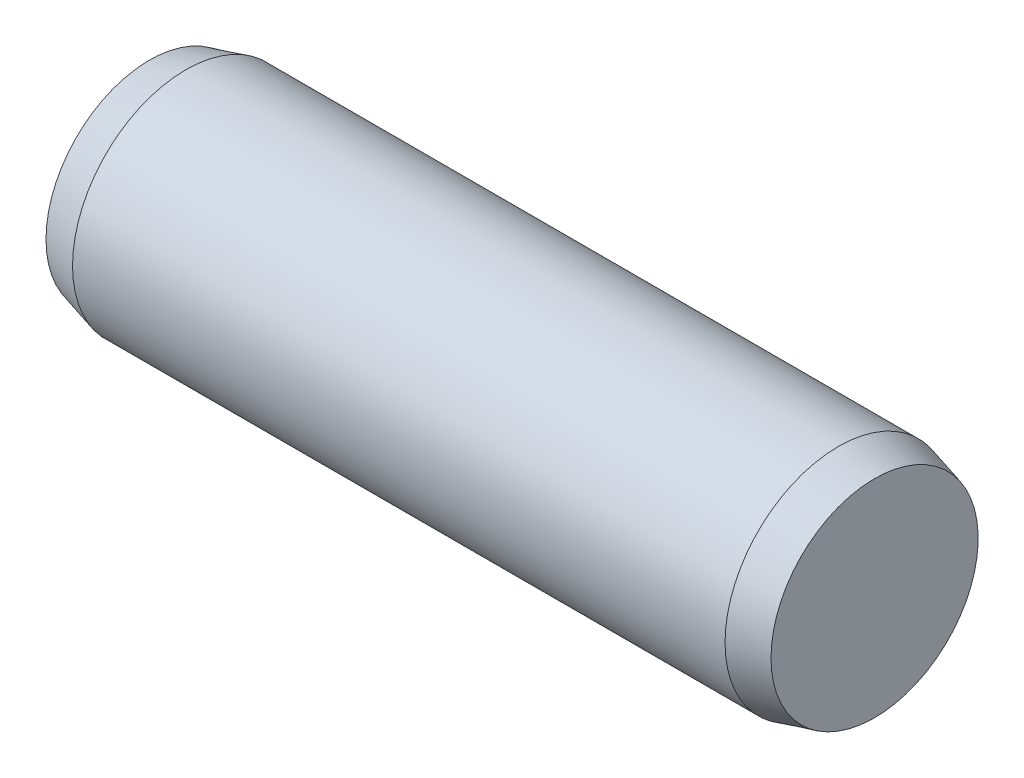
from build123d import *


with BuildPart() as part:
    # Sketch1 → Base-Revolve (revolve)
    with BuildSketch(Plane.XY, mode=Mode.PRIVATE) as base_revolve_sk:
        Polygon((0, 0), (16, 0), (16, 2.285640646), (15.2, 2.5), (0.8, 2.5), (0, 2.285640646), align=None)
    revolve(base_revolve_sk.sketch.rotate(Axis((-6.35, 0, 0), (1, 0, 0)), 90), axis=Axis((-6.35, 0, 0), (1, 0, 0)))


solid = part.part
